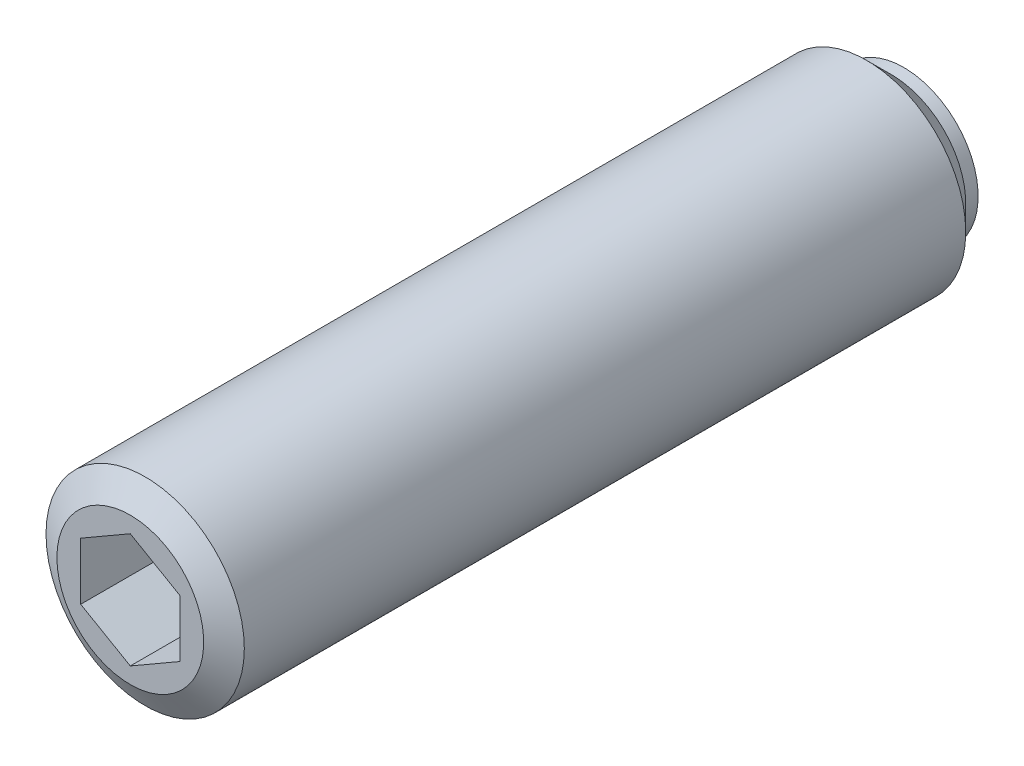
ISO-10303-21;
HEADER;
FILE_DESCRIPTION(('STEP AP214'),'2;1');
FILE_NAME('part.step','',(''),(''),'','','');
FILE_SCHEMA(('AUTOMOTIVE_DESIGN { 1 0 10303 214 1 1 1 1 }'));
ENDSEC;
DATA;
#1=APPLICATION_CONTEXT('core data for automotive mechanical design processes');
#2=APPLICATION_PROTOCOL_DEFINITION('international standard','automotive_design',2000,#1);
#3=PRODUCT_CONTEXT('',#1,'mechanical');
#4=PRODUCT('Part','Part','',(#3));
#5=PRODUCT_RELATED_PRODUCT_CATEGORY('part','',(#4));
#6=PRODUCT_DEFINITION_FORMATION('','',#4);
#7=PRODUCT_DEFINITION_CONTEXT('part definition',#1,'design');
#8=PRODUCT_DEFINITION('design','',#6,#7);
#9=PRODUCT_DEFINITION_SHAPE('','',#8);
#10=(LENGTH_UNIT() NAMED_UNIT(*) SI_UNIT(.MILLI.,.METRE.));
#11=(NAMED_UNIT(*) PLANE_ANGLE_UNIT() SI_UNIT($,.RADIAN.));
#12=(NAMED_UNIT(*) SI_UNIT($,.STERADIAN.) SOLID_ANGLE_UNIT());
#13=UNCERTAINTY_MEASURE_WITH_UNIT(LENGTH_MEASURE(1.E-05),#10,'distance_accuracy_value','');
#14=(GEOMETRIC_REPRESENTATION_CONTEXT(3) GLOBAL_UNCERTAINTY_ASSIGNED_CONTEXT((#13)) GLOBAL_UNIT_ASSIGNED_CONTEXT((#10,
#11,#12)) REPRESENTATION_CONTEXT('',''));
#15=CARTESIAN_POINT('',(0.,0.,0.));
#16=DIRECTION('',(0.,0.,1.));
#17=DIRECTION('',(1.,0.,0.));
#18=AXIS2_PLACEMENT_3D('',#15,#16,#17);
#19=CARTESIAN_POINT('',(0.,0.,1.25));
#20=DIRECTION('',(0.,0.,1.));
#21=DIRECTION('',(0.,-1.,0.));
#22=AXIS2_PLACEMENT_3D('',#19,#20,#21);
#23=SPHERICAL_SURFACE('',#22,1.25);
#24=CARTESIAN_POINT('',(0.,0.,0.4));
#25=DIRECTION('',(0.,0.,1.));
#26=DIRECTION('',(-1.,0.,0.));
#27=AXIS2_PLACEMENT_3D('',#24,#25,#26);
#28=CIRCLE('',#27,0.91651513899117);
#29=CARTESIAN_POINT('',(-0.91651513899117,0.,0.4));
#30=VERTEX_POINT('',#29);
#31=EDGE_CURVE('E9',#30,#30,#28,.T.);
#32=ORIENTED_EDGE('',*,*,#31,.F.);
#33=EDGE_LOOP('',(#32));
#34=FACE_BOUND('',#33,.T.);
#35=ADVANCED_FACE('F14',(#34),#23,.T.);
#36=CARTESIAN_POINT('',(0.,1.5,0.4));
#37=DIRECTION('',(0.,0.,1.));
#38=DIRECTION('',(-1.,0.,0.));
#39=AXIS2_PLACEMENT_3D('',#36,#37,#38);
#40=PLANE('',#39);
#41=CARTESIAN_POINT('',(0.,0.,0.4));
#42=DIRECTION('',(0.,0.,1.));
#43=DIRECTION('',(-1.,0.,0.));
#44=AXIS2_PLACEMENT_3D('',#41,#42,#43);
#45=CIRCLE('',#44,1.5);
#46=CARTESIAN_POINT('',(-1.5,0.,0.4));
#47=VERTEX_POINT('',#46);
#48=EDGE_CURVE('E21',#47,#47,#45,.T.);
#49=ORIENTED_EDGE('',*,*,#48,.F.);
#50=EDGE_LOOP('',(#49));
#51=FACE_BOUND('',#50,.T.);
#52=ORIENTED_EDGE('',*,*,#31,.T.);
#53=EDGE_LOOP('',(#52));
#54=FACE_BOUND('',#53,.T.);
#55=ADVANCED_FACE('F138',(#51,#54),#40,.F.);
#56=CARTESIAN_POINT('',(0.,0.,17.3950749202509));
#57=DIRECTION('',(0.,0.,1.));
#58=DIRECTION('',(-1.,0.,0.));
#59=AXIS2_PLACEMENT_3D('',#56,#57,#58);
#60=CYLINDRICAL_SURFACE('',#59,1.5);
#61=CARTESIAN_POINT('',(0.,0.,0.65));
#62=DIRECTION('',(0.,0.,1.));
#63=DIRECTION('',(-1.,0.,0.));
#64=AXIS2_PLACEMENT_3D('',#61,#62,#63);
#65=CIRCLE('',#64,1.5);
#66=CARTESIAN_POINT('',(-1.5,0.,0.65));
#67=VERTEX_POINT('',#66);
#68=EDGE_CURVE('E131',#67,#67,#65,.T.);
#69=ORIENTED_EDGE('',*,*,#68,.F.);
#70=EDGE_LOOP('',(#69));
#71=FACE_BOUND('',#70,.T.);
#72=ORIENTED_EDGE('',*,*,#48,.T.);
#73=EDGE_LOOP('',(#72));
#74=FACE_BOUND('',#73,.T.);
#75=ADVANCED_FACE('F136',(#71,#74),#60,.T.);
#76=CARTESIAN_POINT('',(0.,0.,0.65));
#77=DIRECTION('',(0.,0.,1.));
#78=DIRECTION('',(-1.,0.,0.));
#79=AXIS2_PLACEMENT_3D('',#76,#77,#78);
#80=CONICAL_SURFACE('',#79,1.5,0.78539816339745);
#81=CARTESIAN_POINT('',(0.,0.,1.15));
#82=DIRECTION('',(0.,0.,1.));
#83=DIRECTION('',(-1.,0.,0.));
#84=AXIS2_PLACEMENT_3D('',#81,#82,#83);
#85=CIRCLE('',#84,2.);
#86=CARTESIAN_POINT('',(-2.,0.,1.15));
#87=VERTEX_POINT('',#86);
#88=EDGE_CURVE('E128',#87,#87,#85,.T.);
#89=ORIENTED_EDGE('',*,*,#88,.F.);
#90=EDGE_LOOP('',(#89));
#91=FACE_BOUND('',#90,.T.);
#92=ORIENTED_EDGE('',*,*,#68,.T.);
#93=EDGE_LOOP('',(#92));
#94=FACE_BOUND('',#93,.T.);
#95=ADVANCED_FACE('F161',(#91,#94),#80,.T.);
#96=CARTESIAN_POINT('',(0.,0.,17.3950749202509));
#97=DIRECTION('',(0.,0.,1.));
#98=DIRECTION('',(-1.,0.,0.));
#99=AXIS2_PLACEMENT_3D('',#96,#97,#98);
#100=CYLINDRICAL_SURFACE('',#99,2.);
#101=CARTESIAN_POINT('',(0.,0.,15.7));
#102=DIRECTION('',(0.,0.,1.));
#103=DIRECTION('',(-1.,0.,0.));
#104=AXIS2_PLACEMENT_3D('',#101,#102,#103);
#105=CIRCLE('',#104,2.);
#106=CARTESIAN_POINT('',(-2.,0.,15.7));
#107=VERTEX_POINT('',#106);
#108=EDGE_CURVE('E125',#107,#107,#105,.T.);
#109=ORIENTED_EDGE('',*,*,#108,.F.);
#110=EDGE_LOOP('',(#109));
#111=FACE_BOUND('',#110,.T.);
#112=ORIENTED_EDGE('',*,*,#88,.T.);
#113=EDGE_LOOP('',(#112));
#114=FACE_BOUND('',#113,.T.);
#115=ADVANCED_FACE('F170',(#111,#114),#100,.T.);
#116=CARTESIAN_POINT('',(0.,0.,15.7));
#117=DIRECTION('',(0.,0.,-1.));
#118=DIRECTION('',(1.,0.,0.));
#119=AXIS2_PLACEMENT_3D('',#116,#117,#118);
#120=CONICAL_SURFACE('',#119,2.,1.04719755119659);
#121=CARTESIAN_POINT('',(0.,0.,16.));
#122=DIRECTION('',(0.,0.,1.));
#123=DIRECTION('',(-1.,0.,0.));
#124=AXIS2_PLACEMENT_3D('',#121,#122,#123);
#125=CIRCLE('',#124,1.48038475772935);
#126=CARTESIAN_POINT('',(-1.48038475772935,0.,16.));
#127=VERTEX_POINT('',#126);
#128=EDGE_CURVE('E116',#127,#127,#125,.T.);
#129=ORIENTED_EDGE('',*,*,#128,.F.);
#130=EDGE_LOOP('',(#129));
#131=FACE_BOUND('',#130,.T.);
#132=ORIENTED_EDGE('',*,*,#108,.T.);
#133=EDGE_LOOP('',(#132));
#134=FACE_BOUND('',#133,.T.);
#135=ADVANCED_FACE('F179',(#131,#134),#120,.T.);
#136=CARTESIAN_POINT('',(0.,0.,16.));
#137=DIRECTION('',(0.,0.,-1.));
#138=DIRECTION('',(1.,0.,0.));
#139=AXIS2_PLACEMENT_3D('',#136,#137,#138);
#140=PLANE('',#139);
#141=DIRECTION('',(-0.866025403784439,-0.5,0.));
#142=VECTOR('',#141,1.);
#143=CARTESIAN_POINT('',(0.,1.15470053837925,16.));
#144=LINE('',#143,#142);
#145=CARTESIAN_POINT('',(0.,1.15470053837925,16.));
#146=VERTEX_POINT('',#145);
#147=CARTESIAN_POINT('',(-1.,0.577350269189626,16.));
#148=VERTEX_POINT('',#147);
#149=EDGE_CURVE('E82',#146,#148,#144,.T.);
#150=ORIENTED_EDGE('',*,*,#149,.F.);
#151=DIRECTION('',(-0.866025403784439,0.5,0.));
#152=VECTOR('',#151,1.);
#153=CARTESIAN_POINT('',(1.,0.577350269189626,16.));
#154=LINE('',#153,#152);
#155=CARTESIAN_POINT('',(1.,0.577350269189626,16.));
#156=VERTEX_POINT('',#155);
#157=EDGE_CURVE('E28',#156,#146,#154,.T.);
#158=ORIENTED_EDGE('',*,*,#157,.F.);
#159=DIRECTION('',(0.,1.,0.));
#160=VECTOR('',#159,1.);
#161=CARTESIAN_POINT('',(1.,-0.577350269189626,16.));
#162=LINE('',#161,#160);
#163=CARTESIAN_POINT('',(1.,-0.577350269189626,16.));
#164=VERTEX_POINT('',#163);
#165=EDGE_CURVE('E98',#164,#156,#162,.T.);
#166=ORIENTED_EDGE('',*,*,#165,.F.);
#167=DIRECTION('',(0.866025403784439,0.5,0.));
#168=VECTOR('',#167,1.);
#169=CARTESIAN_POINT('',(0.,-1.15470053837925,16.));
#170=LINE('',#169,#168);
#171=CARTESIAN_POINT('',(0.,-1.15470053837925,16.));
#172=VERTEX_POINT('',#171);
#173=EDGE_CURVE('E92',#172,#164,#170,.T.);
#174=ORIENTED_EDGE('',*,*,#173,.F.);
#175=DIRECTION('',(0.866025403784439,-0.5,0.));
#176=VECTOR('',#175,1.);
#177=CARTESIAN_POINT('',(-1.,-0.577350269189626,16.));
#178=LINE('',#177,#176);
#179=CARTESIAN_POINT('',(-1.,-0.577350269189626,16.));
#180=VERTEX_POINT('',#179);
#181=EDGE_CURVE('E90',#180,#172,#178,.T.);
#182=ORIENTED_EDGE('',*,*,#181,.F.);
#183=DIRECTION('',(0.,-1.,0.));
#184=VECTOR('',#183,1.);
#185=CARTESIAN_POINT('',(-1.,0.577350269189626,16.));
#186=LINE('',#185,#184);
#187=EDGE_CURVE('E71',#148,#180,#186,.T.);
#188=ORIENTED_EDGE('',*,*,#187,.F.);
#189=EDGE_LOOP('',(#150,#158,#166,#174,#182,#188));
#190=FACE_BOUND('',#189,.T.);
#191=ORIENTED_EDGE('',*,*,#128,.T.);
#192=EDGE_LOOP('',(#191));
#193=FACE_BOUND('',#192,.T.);
#194=ADVANCED_FACE('F86',(#190,#193),#140,.F.);
#195=CARTESIAN_POINT('',(1.,0.577350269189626,14.));
#196=DIRECTION('',(0.5,0.866025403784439,0.));
#197=DIRECTION('',(0.866025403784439,-0.5,0.));
#198=AXIS2_PLACEMENT_3D('',#195,#196,#197);
#199=PLANE('',#198);
#200=ORIENTED_EDGE('',*,*,#157,.T.);
#201=DIRECTION('',(0.,0.,1.));
#202=VECTOR('',#201,1.);
#203=CARTESIAN_POINT('',(0.,1.15470053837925,14.));
#204=LINE('',#203,#202);
#205=CARTESIAN_POINT('',(0.,1.15470053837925,14.));
#206=VERTEX_POINT('',#205);
#207=EDGE_CURVE('E79',#206,#146,#204,.T.);
#208=ORIENTED_EDGE('',*,*,#207,.F.);
#209=DIRECTION('',(-0.866025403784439,0.5,0.));
#210=VECTOR('',#209,1.);
#211=CARTESIAN_POINT('',(1.,0.577350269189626,14.));
#212=LINE('',#211,#210);
#213=CARTESIAN_POINT('',(1.,0.577350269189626,14.));
#214=VERTEX_POINT('',#213);
#215=EDGE_CURVE('E100',#214,#206,#212,.T.);
#216=ORIENTED_EDGE('',*,*,#215,.F.);
#217=DIRECTION('',(0.,0.,1.));
#218=VECTOR('',#217,1.);
#219=CARTESIAN_POINT('',(1.,0.577350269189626,14.));
#220=LINE('',#219,#218);
#221=EDGE_CURVE('E35',#214,#156,#220,.T.);
#222=ORIENTED_EDGE('',*,*,#221,.T.);
#223=EDGE_LOOP('',(#200,#208,#216,#222));
#224=FACE_BOUND('',#223,.T.);
#225=ADVANCED_FACE('F196',(#224),#199,.F.);
#226=CARTESIAN_POINT('',(1.,-0.577350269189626,14.));
#227=DIRECTION('',(1.,0.,0.));
#228=DIRECTION('',(0.,-1.,0.));
#229=AXIS2_PLACEMENT_3D('',#226,#227,#228);
#230=PLANE('',#229);
#231=ORIENTED_EDGE('',*,*,#165,.T.);
#232=ORIENTED_EDGE('',*,*,#221,.F.);
#233=DIRECTION('',(0.,1.,0.));
#234=VECTOR('',#233,1.);
#235=CARTESIAN_POINT('',(1.,-0.577350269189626,14.));
#236=LINE('',#235,#234);
#237=CARTESIAN_POINT('',(1.,-0.577350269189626,14.));
#238=VERTEX_POINT('',#237);
#239=EDGE_CURVE('E112',#238,#214,#236,.T.);
#240=ORIENTED_EDGE('',*,*,#239,.F.);
#241=DIRECTION('',(0.,0.,1.));
#242=VECTOR('',#241,1.);
#243=CARTESIAN_POINT('',(1.,-0.577350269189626,14.));
#244=LINE('',#243,#242);
#245=EDGE_CURVE('E117',#238,#164,#244,.T.);
#246=ORIENTED_EDGE('',*,*,#245,.T.);
#247=EDGE_LOOP('',(#231,#232,#240,#246));
#248=FACE_BOUND('',#247,.T.);
#249=ADVANCED_FACE('F204',(#248),#230,.F.);
#250=CARTESIAN_POINT('',(0.,-1.15470053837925,14.));
#251=DIRECTION('',(0.5,-0.866025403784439,0.));
#252=DIRECTION('',(-0.866025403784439,-0.5,0.));
#253=AXIS2_PLACEMENT_3D('',#250,#251,#252);
#254=PLANE('',#253);
#255=ORIENTED_EDGE('',*,*,#173,.T.);
#256=ORIENTED_EDGE('',*,*,#245,.F.);
#257=DIRECTION('',(0.866025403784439,0.5,0.));
#258=VECTOR('',#257,1.);
#259=CARTESIAN_POINT('',(0.,-1.15470053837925,14.));
#260=LINE('',#259,#258);
#261=CARTESIAN_POINT('',(0.,-1.15470053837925,14.));
#262=VERTEX_POINT('',#261);
#263=EDGE_CURVE('E109',#262,#238,#260,.T.);
#264=ORIENTED_EDGE('',*,*,#263,.F.);
#265=DIRECTION('',(0.,0.,1.));
#266=VECTOR('',#265,1.);
#267=CARTESIAN_POINT('',(0.,-1.15470053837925,14.));
#268=LINE('',#267,#266);
#269=EDGE_CURVE('E119',#262,#172,#268,.T.);
#270=ORIENTED_EDGE('',*,*,#269,.T.);
#271=EDGE_LOOP('',(#255,#256,#264,#270));
#272=FACE_BOUND('',#271,.T.);
#273=ADVANCED_FACE('F212',(#272),#254,.F.);
#274=CARTESIAN_POINT('',(-1.,-0.577350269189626,14.));
#275=DIRECTION('',(-0.5,-0.866025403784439,0.));
#276=DIRECTION('',(-0.866025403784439,0.5,0.));
#277=AXIS2_PLACEMENT_3D('',#274,#275,#276);
#278=PLANE('',#277);
#279=ORIENTED_EDGE('',*,*,#181,.T.);
#280=ORIENTED_EDGE('',*,*,#269,.F.);
#281=DIRECTION('',(0.866025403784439,-0.5,0.));
#282=VECTOR('',#281,1.);
#283=CARTESIAN_POINT('',(-1.,-0.577350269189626,14.));
#284=LINE('',#283,#282);
#285=CARTESIAN_POINT('',(-1.,-0.577350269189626,14.));
#286=VERTEX_POINT('',#285);
#287=EDGE_CURVE('E106',#286,#262,#284,.T.);
#288=ORIENTED_EDGE('',*,*,#287,.F.);
#289=DIRECTION('',(0.,0.,1.));
#290=VECTOR('',#289,1.);
#291=CARTESIAN_POINT('',(-1.,-0.577350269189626,14.));
#292=LINE('',#291,#290);
#293=EDGE_CURVE('E78',#286,#180,#292,.T.);
#294=ORIENTED_EDGE('',*,*,#293,.T.);
#295=EDGE_LOOP('',(#279,#280,#288,#294));
#296=FACE_BOUND('',#295,.T.);
#297=ADVANCED_FACE('F220',(#296),#278,.F.);
#298=CARTESIAN_POINT('',(-1.,0.577350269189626,14.));
#299=DIRECTION('',(-1.,0.,0.));
#300=DIRECTION('',(0.,1.,0.));
#301=AXIS2_PLACEMENT_3D('',#298,#299,#300);
#302=PLANE('',#301);
#303=ORIENTED_EDGE('',*,*,#187,.T.);
#304=ORIENTED_EDGE('',*,*,#293,.F.);
#305=DIRECTION('',(0.,-1.,0.));
#306=VECTOR('',#305,1.);
#307=CARTESIAN_POINT('',(-1.,0.577350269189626,14.));
#308=LINE('',#307,#306);
#309=CARTESIAN_POINT('',(-1.,0.577350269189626,14.));
#310=VERTEX_POINT('',#309);
#311=EDGE_CURVE('E74',#310,#286,#308,.T.);
#312=ORIENTED_EDGE('',*,*,#311,.F.);
#313=DIRECTION('',(0.,0.,1.));
#314=VECTOR('',#313,1.);
#315=CARTESIAN_POINT('',(-1.,0.577350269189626,14.));
#316=LINE('',#315,#314);
#317=EDGE_CURVE('E67',#310,#148,#316,.T.);
#318=ORIENTED_EDGE('',*,*,#317,.T.);
#319=EDGE_LOOP('',(#303,#304,#312,#318));
#320=FACE_BOUND('',#319,.T.);
#321=ADVANCED_FACE('F69',(#320),#302,.F.);
#322=CARTESIAN_POINT('',(0.,1.15470053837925,14.));
#323=DIRECTION('',(-0.5,0.866025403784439,0.));
#324=DIRECTION('',(0.866025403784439,0.5,0.));
#325=AXIS2_PLACEMENT_3D('',#322,#323,#324);
#326=PLANE('',#325);
#327=ORIENTED_EDGE('',*,*,#149,.T.);
#328=ORIENTED_EDGE('',*,*,#317,.F.);
#329=DIRECTION('',(-0.866025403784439,-0.5,0.));
#330=VECTOR('',#329,1.);
#331=CARTESIAN_POINT('',(0.,1.15470053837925,14.));
#332=LINE('',#331,#330);
#333=EDGE_CURVE('E103',#206,#310,#332,.T.);
#334=ORIENTED_EDGE('',*,*,#333,.F.);
#335=ORIENTED_EDGE('',*,*,#207,.T.);
#336=EDGE_LOOP('',(#327,#328,#334,#335));
#337=FACE_BOUND('',#336,.T.);
#338=ADVANCED_FACE('F83',(#337),#326,.F.);
#339=CARTESIAN_POINT('',(0.,1.15470053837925,14.));
#340=DIRECTION('',(0.,0.,1.));
#341=DIRECTION('',(-1.,0.,0.));
#342=AXIS2_PLACEMENT_3D('',#339,#340,#341);
#343=PLANE('',#342);
#344=ORIENTED_EDGE('',*,*,#215,.T.);
#345=ORIENTED_EDGE('',*,*,#333,.T.);
#346=ORIENTED_EDGE('',*,*,#311,.T.);
#347=ORIENTED_EDGE('',*,*,#287,.T.);
#348=ORIENTED_EDGE('',*,*,#263,.T.);
#349=ORIENTED_EDGE('',*,*,#239,.T.);
#350=EDGE_LOOP('',(#344,#345,#346,#347,#348,#349));
#351=FACE_BOUND('',#350,.T.);
#352=ADVANCED_FACE('F244',(#351),#343,.T.);
#353=CLOSED_SHELL('',(#35,#55,#75,#95,#115,#135,#194,#225,#249,#273,#297,#321,#338,#352));
#354=MANIFOLD_SOLID_BREP('B1',#353);
#355=ADVANCED_BREP_SHAPE_REPRESENTATION('',(#18,#354),#14);
#356=SHAPE_DEFINITION_REPRESENTATION(#9,#355);
ENDSEC;
END-ISO-10303-21;
